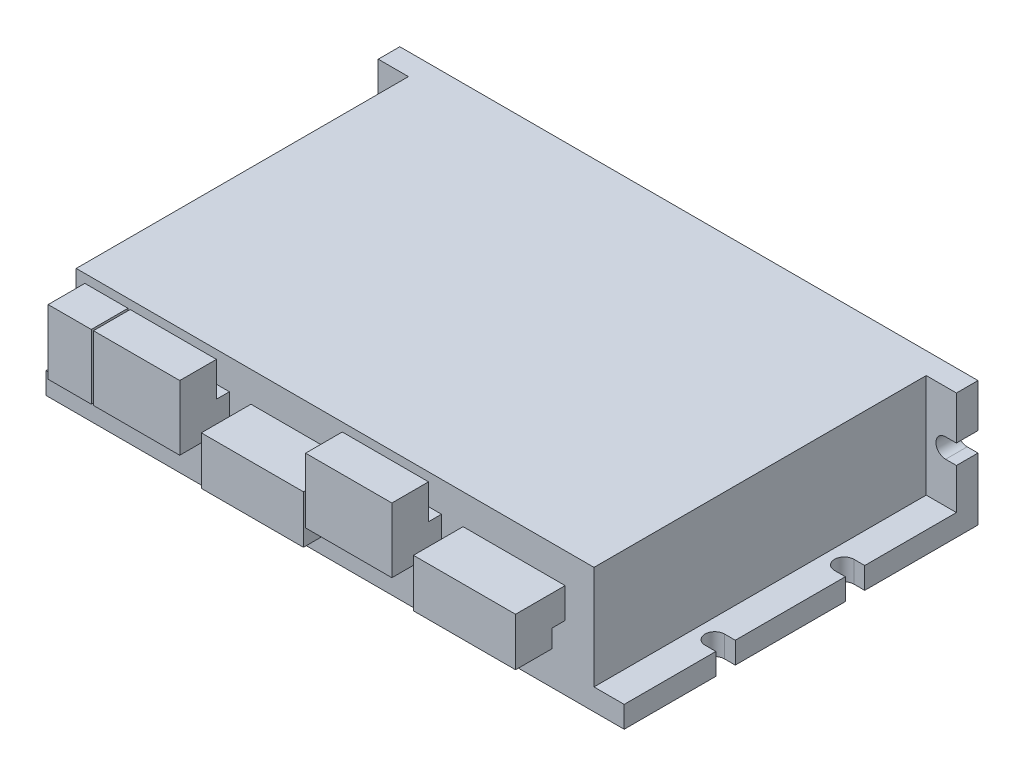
from build123d import *

# Parameters (mm, degrees)
SKETCH_1_W          = 134
SKETCH_1_H          = 82
EXTRUDE_1_DEPTH     = 29
SKETCH_2_W          = 7
SKETCH_2_H          = 24
CUT_EXTRUDE_1_DEPTH = 77
CUT_EXTRUDE_7_DEPTH = 5
CUT_EXTRUDE_8_DEPTH = 5
SKETCH_5_W          = 10
SKETCH_5_H          = 7
SKETCH_5_W_2        = 23.66
SKETCH_5_W_3        = 20
EXTRUDE_2_DEPTH     = 3
SKETCH_7_W          = 10
SKETCH_7_H          = 15
SKETCH_7_W_2        = 20
SKETCH_7_W_3        = 23.66
SKETCH_7_H_2        = 11.15
EXTRUDE_3_DEPTH     = 8.5


with BuildPart() as part:
    # Sketch 1 → Extrude 1 (new body)
    with BuildSketch(Plane(origin=(0, 0, 0), x_dir=(1, 0, 0), z_dir=(0, 1, 0))):
        with Locations((67, 41)):
            Rectangle(SKETCH_1_W, SKETCH_1_H)
    extrude(amount=EXTRUDE_1_DEPTH)

    # Sketch 2 → Cut-Extrude 1 (cut)
    with BuildSketch(Plane.XY):
        with Locations((3.5, 17)):
            Rectangle(SKETCH_2_W, SKETCH_2_H)
        with Locations((130.5, 17)):
            Rectangle(SKETCH_2_W, SKETCH_2_H)
    extrude(amount=-CUT_EXTRUDE_1_DEPTH, mode=Mode.SUBTRACT)

    # Sketch 3 → Cut-Extrude 7 (cut)
    with BuildSketch(Plane(origin=(0, 0, 0), x_dir=(1, 0, 0), z_dir=(0, 1, 0))):
        with BuildLine():
            Line((2.5, 25.75), (0, 25.75))
            Line((0, 25.75), (0, 21.25))
            Line((0, 21.25), (2.5, 21.25))
            ThreePointArc((2.5, 21.25), (4.75, 23.5), (2.5, 25.75))
        make_face()
        with BuildLine():
            Line((131.5, 55.75), (134, 55.75))
            Line((134, 55.75), (134, 51.25))
            Line((134, 51.25), (131.5, 51.25))
            ThreePointArc((131.5, 51.25), (129.25, 53.5), (131.5, 55.75))
        make_face()
        with BuildLine():
            Line((2.5, 55.75), (0, 55.75))
            Line((0, 55.75), (0, 51.25))
            Line((0, 51.25), (2.5, 51.25))
            ThreePointArc((2.5, 51.25), (4.75, 53.5), (2.5, 55.75))
        make_face()
        with BuildLine():
            Line((131.5, 25.75), (134, 25.75))
            Line((134, 25.75), (134, 21.25))
            Line((134, 21.25), (131.5, 21.25))
            ThreePointArc((131.5, 21.25), (129.25, 23.5), (131.5, 25.75))
        make_face()
    extrude(amount=CUT_EXTRUDE_7_DEPTH, mode=Mode.SUBTRACT)

    # Sketch 4 → Cut-Extrude 8 (cut)
    with BuildSketch(Plane.XY.offset(-77)):
        with BuildLine():
            Line((2.5, 18.95), (0, 18.95))
            Line((0, 18.95), (0, 14.45))
            Line((0, 14.45), (2.5, 14.45))
            ThreePointArc((2.5, 14.45), (4.75, 16.7), (2.5, 18.95))
        make_face()
        with BuildLine():
            Line((131.5, 18.95), (134, 18.95))
            Line((134, 18.95), (134, 14.45))
            Line((134, 14.45), (131.5, 14.45))
            ThreePointArc((131.5, 14.45), (129.25, 16.7), (131.5, 18.95))
        make_face()
    extrude(amount=-CUT_EXTRUDE_8_DEPTH, mode=Mode.SUBTRACT)

    # Sketch 5 → Extrude 2 (add)
    with BuildSketch(Plane.XY):
        with Locations((17, 18.5)):
            Rectangle(SKETCH_5_W, SKETCH_5_H)
        with Locations((59.33, 18.5)):
            Rectangle(SKETCH_5_W_2, SKETCH_5_H)
        with Locations((32.5, 18.5)):
            Rectangle(SKETCH_5_W_3, SKETCH_5_H)
        with Locations((108.49, 18.5)):
            Rectangle(SKETCH_5_W_2, SKETCH_5_H)
        with Locations((81.66, 18.5)):
            Rectangle(SKETCH_5_W_3, SKETCH_5_H)
    extrude(amount=EXTRUDE_2_DEPTH)

    # Sketch 7 → Extrude 3 (add)
    with BuildSketch(Plane.XY.offset(3)):
        with Locations((17, 22.5)):
            Rectangle(SKETCH_7_W, SKETCH_7_H)
        with Locations((32.5, 22.5)):
            Rectangle(SKETCH_7_W_2, SKETCH_7_H)
        with Locations((81.66, 22.5)):
            Rectangle(SKETCH_7_W_2, SKETCH_7_H)
        with Locations((59.33, 16.425)):
            Rectangle(SKETCH_7_W_3, SKETCH_7_H_2)
        with Locations((108.49, 16.425)):
            Rectangle(SKETCH_7_W_3, SKETCH_7_H_2)
    extrude(amount=EXTRUDE_3_DEPTH)


solid = part.part
